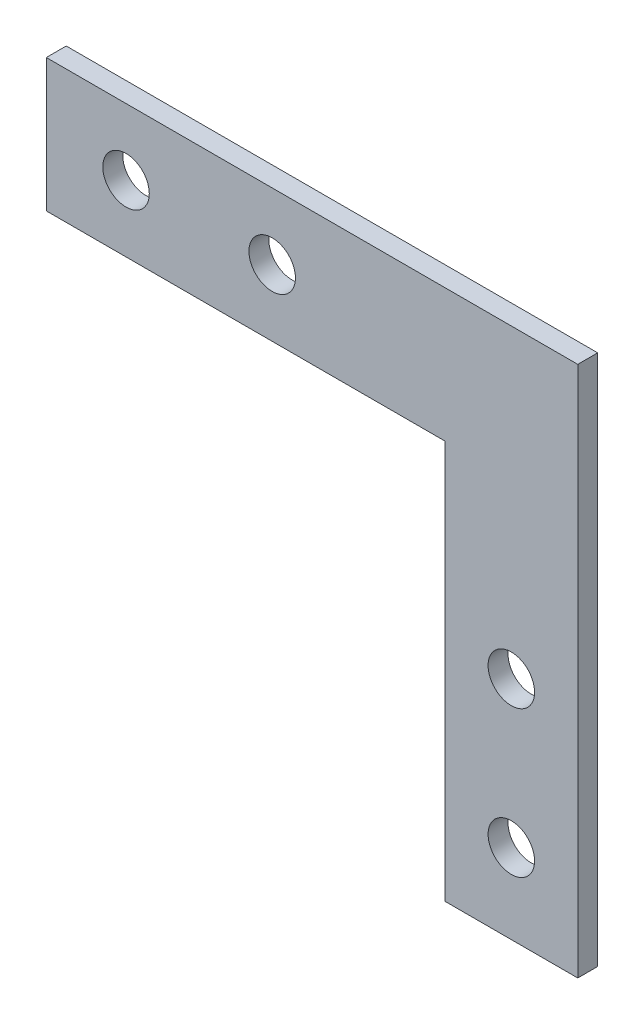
ISO-10303-21;
HEADER;
FILE_DESCRIPTION(('STEP AP214'),'2;1');
FILE_NAME('part.step','',(''),(''),'','','');
FILE_SCHEMA(('AUTOMOTIVE_DESIGN { 1 0 10303 214 1 1 1 1 }'));
ENDSEC;
DATA;
#1=APPLICATION_CONTEXT('core data for automotive mechanical design processes');
#2=APPLICATION_PROTOCOL_DEFINITION('international standard','automotive_design',2000,#1);
#3=PRODUCT_CONTEXT('',#1,'mechanical');
#4=PRODUCT('Part','Part','',(#3));
#5=PRODUCT_RELATED_PRODUCT_CATEGORY('part','',(#4));
#6=PRODUCT_DEFINITION_FORMATION('','',#4);
#7=PRODUCT_DEFINITION_CONTEXT('part definition',#1,'design');
#8=PRODUCT_DEFINITION('design','',#6,#7);
#9=PRODUCT_DEFINITION_SHAPE('','',#8);
#10=(LENGTH_UNIT() NAMED_UNIT(*) SI_UNIT(.MILLI.,.METRE.));
#11=(NAMED_UNIT(*) PLANE_ANGLE_UNIT() SI_UNIT($,.RADIAN.));
#12=(NAMED_UNIT(*) SI_UNIT($,.STERADIAN.) SOLID_ANGLE_UNIT());
#13=UNCERTAINTY_MEASURE_WITH_UNIT(LENGTH_MEASURE(1.E-05),#10,'distance_accuracy_value','');
#14=(GEOMETRIC_REPRESENTATION_CONTEXT(3) GLOBAL_UNCERTAINTY_ASSIGNED_CONTEXT((#13)) GLOBAL_UNIT_ASSIGNED_CONTEXT((#10,
#11,#12)) REPRESENTATION_CONTEXT('',''));
#15=CARTESIAN_POINT('',(0.,0.,0.));
#16=DIRECTION('',(0.,0.,1.));
#17=DIRECTION('',(1.,0.,0.));
#18=AXIS2_PLACEMENT_3D('',#15,#16,#17);
#19=CARTESIAN_POINT('',(0.,20.,3.));
#20=DIRECTION('',(0.,0.,-1.));
#21=DIRECTION('',(-1.,0.,0.));
#22=AXIS2_PLACEMENT_3D('',#19,#20,#21);
#23=PLANE('',#22);
#24=DIRECTION('',(0.,-1.,0.));
#25=VECTOR('',#24,1.);
#26=CARTESIAN_POINT('',(0.,0.,3.));
#27=LINE('',#26,#25);
#28=CARTESIAN_POINT('',(0.,20.,3.));
#29=VERTEX_POINT('',#28);
#30=CARTESIAN_POINT('',(0.,0.,3.));
#31=VERTEX_POINT('',#30);
#32=EDGE_CURVE('E130',#29,#31,#27,.T.);
#33=ORIENTED_EDGE('',*,*,#32,.T.);
#34=DIRECTION('',(1.,0.,0.));
#35=VECTOR('',#34,1.);
#36=CARTESIAN_POINT('',(0.,0.,3.));
#37=LINE('',#36,#35);
#38=CARTESIAN_POINT('',(60.,0.,3.));
#39=VERTEX_POINT('',#38);
#40=EDGE_CURVE('E87',#31,#39,#37,.T.);
#41=ORIENTED_EDGE('',*,*,#40,.T.);
#42=DIRECTION('',(0.,-1.,0.));
#43=VECTOR('',#42,1.);
#44=CARTESIAN_POINT('',(60.,0.,3.));
#45=LINE('',#44,#43);
#46=CARTESIAN_POINT('',(60.,-60.,3.));
#47=VERTEX_POINT('',#46);
#48=EDGE_CURVE('E100',#39,#47,#45,.T.);
#49=ORIENTED_EDGE('',*,*,#48,.T.);
#50=DIRECTION('',(1.,0.,0.));
#51=VECTOR('',#50,1.);
#52=CARTESIAN_POINT('',(80.,-60.,3.));
#53=LINE('',#52,#51);
#54=CARTESIAN_POINT('',(80.,-60.,3.));
#55=VERTEX_POINT('',#54);
#56=EDGE_CURVE('E94',#47,#55,#53,.T.);
#57=ORIENTED_EDGE('',*,*,#56,.T.);
#58=DIRECTION('',(0.,1.,0.));
#59=VECTOR('',#58,1.);
#60=CARTESIAN_POINT('',(80.,0.,3.));
#61=LINE('',#60,#59);
#62=CARTESIAN_POINT('',(80.,20.,3.));
#63=VERTEX_POINT('',#62);
#64=EDGE_CURVE('E98',#55,#63,#61,.T.);
#65=ORIENTED_EDGE('',*,*,#64,.T.);
#66=DIRECTION('',(-1.,0.,0.));
#67=VECTOR('',#66,1.);
#68=CARTESIAN_POINT('',(0.,20.,3.));
#69=LINE('',#68,#67);
#70=EDGE_CURVE('E51',#63,#29,#69,.T.);
#71=ORIENTED_EDGE('',*,*,#70,.T.);
#72=EDGE_LOOP('',(#33,#41,#49,#57,#65,#71));
#73=FACE_BOUND('',#72,.T.);
#74=CARTESIAN_POINT('',(12.,10.,3.));
#75=DIRECTION('',(0.,0.,1.));
#76=DIRECTION('',(1.,0.,0.));
#77=AXIS2_PLACEMENT_3D('',#74,#75,#76);
#78=CIRCLE('',#77,3.5);
#79=CARTESIAN_POINT('',(15.5,10.,3.));
#80=VERTEX_POINT('',#79);
#81=EDGE_CURVE('E123',#80,#80,#78,.T.);
#82=ORIENTED_EDGE('',*,*,#81,.F.);
#83=EDGE_LOOP('',(#82));
#84=FACE_BOUND('',#83,.T.);
#85=CARTESIAN_POINT('',(34.,10.,3.));
#86=DIRECTION('',(0.,0.,1.));
#87=DIRECTION('',(1.,0.,0.));
#88=AXIS2_PLACEMENT_3D('',#85,#86,#87);
#89=CIRCLE('',#88,3.5);
#90=CARTESIAN_POINT('',(37.5,10.,3.));
#91=VERTEX_POINT('',#90);
#92=EDGE_CURVE('E194',#91,#91,#89,.T.);
#93=ORIENTED_EDGE('',*,*,#92,.F.);
#94=EDGE_LOOP('',(#93));
#95=FACE_BOUND('',#94,.T.);
#96=CARTESIAN_POINT('',(70.,-48.,3.));
#97=DIRECTION('',(0.,0.,1.));
#98=DIRECTION('',(1.,0.,0.));
#99=AXIS2_PLACEMENT_3D('',#96,#97,#98);
#100=CIRCLE('',#99,3.50000000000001);
#101=CARTESIAN_POINT('',(73.5,-48.,3.));
#102=VERTEX_POINT('',#101);
#103=EDGE_CURVE('E188',#102,#102,#100,.T.);
#104=ORIENTED_EDGE('',*,*,#103,.F.);
#105=EDGE_LOOP('',(#104));
#106=FACE_BOUND('',#105,.T.);
#107=CARTESIAN_POINT('',(70.,-26.,3.));
#108=DIRECTION('',(0.,0.,1.));
#109=DIRECTION('',(1.,0.,0.));
#110=AXIS2_PLACEMENT_3D('',#107,#108,#109);
#111=CIRCLE('',#110,3.50000000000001);
#112=CARTESIAN_POINT('',(73.5,-26.,3.));
#113=VERTEX_POINT('',#112);
#114=EDGE_CURVE('E179',#113,#113,#111,.T.);
#115=ORIENTED_EDGE('',*,*,#114,.F.);
#116=EDGE_LOOP('',(#115));
#117=FACE_BOUND('',#116,.T.);
#118=ADVANCED_FACE('F34',(#73,#84,#95,#106,#117),#23,.F.);
#119=CARTESIAN_POINT('',(0.,20.,0.));
#120=DIRECTION('',(0.,0.,-1.));
#121=DIRECTION('',(-1.,0.,0.));
#122=AXIS2_PLACEMENT_3D('',#119,#120,#121);
#123=PLANE('',#122);
#124=CARTESIAN_POINT('',(70.,-48.,0.));
#125=DIRECTION('',(0.,0.,1.));
#126=DIRECTION('',(1.,0.,0.));
#127=AXIS2_PLACEMENT_3D('',#124,#125,#126);
#128=CIRCLE('',#127,3.50000000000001);
#129=CARTESIAN_POINT('',(73.5,-48.,0.));
#130=VERTEX_POINT('',#129);
#131=EDGE_CURVE('E185',#130,#130,#128,.T.);
#132=ORIENTED_EDGE('',*,*,#131,.T.);
#133=EDGE_LOOP('',(#132));
#134=FACE_BOUND('',#133,.T.);
#135=CARTESIAN_POINT('',(12.,10.,0.));
#136=DIRECTION('',(0.,0.,1.));
#137=DIRECTION('',(1.,0.,0.));
#138=AXIS2_PLACEMENT_3D('',#135,#136,#137);
#139=CIRCLE('',#138,3.5);
#140=CARTESIAN_POINT('',(15.5,10.,0.));
#141=VERTEX_POINT('',#140);
#142=EDGE_CURVE('E197',#141,#141,#139,.T.);
#143=ORIENTED_EDGE('',*,*,#142,.T.);
#144=EDGE_LOOP('',(#143));
#145=FACE_BOUND('',#144,.T.);
#146=DIRECTION('',(0.,-1.,0.));
#147=VECTOR('',#146,1.);
#148=CARTESIAN_POINT('',(0.,0.,0.));
#149=LINE('',#148,#147);
#150=CARTESIAN_POINT('',(0.,20.,0.));
#151=VERTEX_POINT('',#150);
#152=CARTESIAN_POINT('',(0.,0.,0.));
#153=VERTEX_POINT('',#152);
#154=EDGE_CURVE('E119',#151,#153,#149,.T.);
#155=ORIENTED_EDGE('',*,*,#154,.F.);
#156=DIRECTION('',(-1.,0.,0.));
#157=VECTOR('',#156,1.);
#158=CARTESIAN_POINT('',(0.,20.,0.));
#159=LINE('',#158,#157);
#160=CARTESIAN_POINT('',(80.,20.,0.));
#161=VERTEX_POINT('',#160);
#162=EDGE_CURVE('E79',#161,#151,#159,.T.);
#163=ORIENTED_EDGE('',*,*,#162,.F.);
#164=DIRECTION('',(0.,1.,0.));
#165=VECTOR('',#164,1.);
#166=CARTESIAN_POINT('',(80.,0.,0.));
#167=LINE('',#166,#165);
#168=CARTESIAN_POINT('',(80.,-60.,0.));
#169=VERTEX_POINT('',#168);
#170=EDGE_CURVE('E73',#169,#161,#167,.T.);
#171=ORIENTED_EDGE('',*,*,#170,.F.);
#172=DIRECTION('',(1.,0.,0.));
#173=VECTOR('',#172,1.);
#174=CARTESIAN_POINT('',(80.,-60.,0.));
#175=LINE('',#174,#173);
#176=CARTESIAN_POINT('',(60.,-60.,0.));
#177=VERTEX_POINT('',#176);
#178=EDGE_CURVE('E109',#177,#169,#175,.T.);
#179=ORIENTED_EDGE('',*,*,#178,.F.);
#180=DIRECTION('',(0.,-1.,0.));
#181=VECTOR('',#180,1.);
#182=CARTESIAN_POINT('',(60.,0.,0.));
#183=LINE('',#182,#181);
#184=CARTESIAN_POINT('',(60.,0.,0.));
#185=VERTEX_POINT('',#184);
#186=EDGE_CURVE('E125',#185,#177,#183,.T.);
#187=ORIENTED_EDGE('',*,*,#186,.F.);
#188=DIRECTION('',(1.,0.,0.));
#189=VECTOR('',#188,1.);
#190=CARTESIAN_POINT('',(0.,0.,0.));
#191=LINE('',#190,#189);
#192=EDGE_CURVE('E122',#153,#185,#191,.T.);
#193=ORIENTED_EDGE('',*,*,#192,.F.);
#194=EDGE_LOOP('',(#155,#163,#171,#179,#187,#193));
#195=FACE_BOUND('',#194,.T.);
#196=CARTESIAN_POINT('',(34.,10.,0.));
#197=DIRECTION('',(0.,0.,1.));
#198=DIRECTION('',(1.,0.,0.));
#199=AXIS2_PLACEMENT_3D('',#196,#197,#198);
#200=CIRCLE('',#199,3.5);
#201=CARTESIAN_POINT('',(37.5,10.,0.));
#202=VERTEX_POINT('',#201);
#203=EDGE_CURVE('E191',#202,#202,#200,.T.);
#204=ORIENTED_EDGE('',*,*,#203,.T.);
#205=EDGE_LOOP('',(#204));
#206=FACE_BOUND('',#205,.T.);
#207=CARTESIAN_POINT('',(70.,-26.,0.));
#208=DIRECTION('',(0.,0.,1.));
#209=DIRECTION('',(1.,0.,0.));
#210=AXIS2_PLACEMENT_3D('',#207,#208,#209);
#211=CIRCLE('',#210,3.50000000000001);
#212=CARTESIAN_POINT('',(73.5,-26.,0.));
#213=VERTEX_POINT('',#212);
#214=EDGE_CURVE('E182',#213,#213,#211,.T.);
#215=ORIENTED_EDGE('',*,*,#214,.T.);
#216=EDGE_LOOP('',(#215));
#217=FACE_BOUND('',#216,.T.);
#218=ADVANCED_FACE('F139',(#134,#145,#195,#206,#217),#123,.T.);
#219=CARTESIAN_POINT('',(0.,0.,3.));
#220=DIRECTION('',(1.,0.,0.));
#221=DIRECTION('',(0.,0.,-1.));
#222=AXIS2_PLACEMENT_3D('',#219,#220,#221);
#223=PLANE('',#222);
#224=ORIENTED_EDGE('',*,*,#154,.T.);
#225=DIRECTION('',(0.,0.,-1.));
#226=VECTOR('',#225,1.);
#227=CARTESIAN_POINT('',(0.,0.,3.));
#228=LINE('',#227,#226);
#229=EDGE_CURVE('E11',#31,#153,#228,.T.);
#230=ORIENTED_EDGE('',*,*,#229,.F.);
#231=ORIENTED_EDGE('',*,*,#32,.F.);
#232=DIRECTION('',(0.,0.,-1.));
#233=VECTOR('',#232,1.);
#234=CARTESIAN_POINT('',(0.,20.,3.));
#235=LINE('',#234,#233);
#236=EDGE_CURVE('E115',#29,#151,#235,.T.);
#237=ORIENTED_EDGE('',*,*,#236,.T.);
#238=EDGE_LOOP('',(#224,#230,#231,#237));
#239=FACE_BOUND('',#238,.T.);
#240=ADVANCED_FACE('F36',(#239),#223,.F.);
#241=CARTESIAN_POINT('',(0.,0.,3.));
#242=DIRECTION('',(0.,1.,0.));
#243=DIRECTION('',(0.,0.,1.));
#244=AXIS2_PLACEMENT_3D('',#241,#242,#243);
#245=PLANE('',#244);
#246=ORIENTED_EDGE('',*,*,#192,.T.);
#247=DIRECTION('',(0.,0.,-1.));
#248=VECTOR('',#247,1.);
#249=CARTESIAN_POINT('',(60.,0.,3.));
#250=LINE('',#249,#248);
#251=EDGE_CURVE('E43',#39,#185,#250,.T.);
#252=ORIENTED_EDGE('',*,*,#251,.F.);
#253=ORIENTED_EDGE('',*,*,#40,.F.);
#254=ORIENTED_EDGE('',*,*,#229,.T.);
#255=EDGE_LOOP('',(#246,#252,#253,#254));
#256=FACE_BOUND('',#255,.T.);
#257=ADVANCED_FACE('F258',(#256),#245,.F.);
#258=CARTESIAN_POINT('',(60.,0.,3.));
#259=DIRECTION('',(1.,0.,0.));
#260=DIRECTION('',(0.,1.,0.));
#261=AXIS2_PLACEMENT_3D('',#258,#259,#260);
#262=PLANE('',#261);
#263=ORIENTED_EDGE('',*,*,#186,.T.);
#264=DIRECTION('',(0.,0.,-1.));
#265=VECTOR('',#264,1.);
#266=CARTESIAN_POINT('',(60.,-60.,3.));
#267=LINE('',#266,#265);
#268=EDGE_CURVE('E110',#47,#177,#267,.T.);
#269=ORIENTED_EDGE('',*,*,#268,.F.);
#270=ORIENTED_EDGE('',*,*,#48,.F.);
#271=ORIENTED_EDGE('',*,*,#251,.T.);
#272=EDGE_LOOP('',(#263,#269,#270,#271));
#273=FACE_BOUND('',#272,.T.);
#274=ADVANCED_FACE('F136',(#273),#262,.F.);
#275=CARTESIAN_POINT('',(80.,-60.,3.));
#276=DIRECTION('',(0.,1.,0.));
#277=DIRECTION('',(-1.,0.,0.));
#278=AXIS2_PLACEMENT_3D('',#275,#276,#277);
#279=PLANE('',#278);
#280=ORIENTED_EDGE('',*,*,#178,.T.);
#281=DIRECTION('',(0.,0.,-1.));
#282=VECTOR('',#281,1.);
#283=CARTESIAN_POINT('',(80.,-60.,3.));
#284=LINE('',#283,#282);
#285=EDGE_CURVE('E106',#55,#169,#284,.T.);
#286=ORIENTED_EDGE('',*,*,#285,.F.);
#287=ORIENTED_EDGE('',*,*,#56,.F.);
#288=ORIENTED_EDGE('',*,*,#268,.T.);
#289=EDGE_LOOP('',(#280,#286,#287,#288));
#290=FACE_BOUND('',#289,.T.);
#291=ADVANCED_FACE('F107',(#290),#279,.F.);
#292=CARTESIAN_POINT('',(80.,0.,3.));
#293=DIRECTION('',(-1.,0.,0.));
#294=DIRECTION('',(0.,0.,1.));
#295=AXIS2_PLACEMENT_3D('',#292,#293,#294);
#296=PLANE('',#295);
#297=ORIENTED_EDGE('',*,*,#170,.T.);
#298=DIRECTION('',(0.,0.,-1.));
#299=VECTOR('',#298,1.);
#300=CARTESIAN_POINT('',(80.,20.,3.));
#301=LINE('',#300,#299);
#302=EDGE_CURVE('E111',#63,#161,#301,.T.);
#303=ORIENTED_EDGE('',*,*,#302,.F.);
#304=ORIENTED_EDGE('',*,*,#64,.F.);
#305=ORIENTED_EDGE('',*,*,#285,.T.);
#306=EDGE_LOOP('',(#297,#303,#304,#305));
#307=FACE_BOUND('',#306,.T.);
#308=ADVANCED_FACE('F113',(#307),#296,.F.);
#309=CARTESIAN_POINT('',(0.,20.,3.));
#310=DIRECTION('',(0.,-1.,0.));
#311=DIRECTION('',(0.,0.,-1.));
#312=AXIS2_PLACEMENT_3D('',#309,#310,#311);
#313=PLANE('',#312);
#314=ORIENTED_EDGE('',*,*,#162,.T.);
#315=ORIENTED_EDGE('',*,*,#236,.F.);
#316=ORIENTED_EDGE('',*,*,#70,.F.);
#317=ORIENTED_EDGE('',*,*,#302,.T.);
#318=EDGE_LOOP('',(#314,#315,#316,#317));
#319=FACE_BOUND('',#318,.T.);
#320=ADVANCED_FACE('F144',(#319),#313,.F.);
#321=CARTESIAN_POINT('',(12.,10.,3.));
#322=DIRECTION('',(0.,0.,-1.));
#323=DIRECTION('',(-1.,0.,0.));
#324=AXIS2_PLACEMENT_3D('',#321,#322,#323);
#325=CYLINDRICAL_SURFACE('',#324,3.5);
#326=ORIENTED_EDGE('',*,*,#81,.T.);
#327=EDGE_LOOP('',(#326));
#328=FACE_BOUND('',#327,.T.);
#329=ORIENTED_EDGE('',*,*,#142,.F.);
#330=EDGE_LOOP('',(#329));
#331=FACE_BOUND('',#330,.T.);
#332=ADVANCED_FACE('F146',(#328,#331),#325,.F.);
#333=CARTESIAN_POINT('',(34.,10.,3.));
#334=DIRECTION('',(0.,0.,-1.));
#335=DIRECTION('',(-1.,0.,0.));
#336=AXIS2_PLACEMENT_3D('',#333,#334,#335);
#337=CYLINDRICAL_SURFACE('',#336,3.5);
#338=ORIENTED_EDGE('',*,*,#92,.T.);
#339=EDGE_LOOP('',(#338));
#340=FACE_BOUND('',#339,.T.);
#341=ORIENTED_EDGE('',*,*,#203,.F.);
#342=EDGE_LOOP('',(#341));
#343=FACE_BOUND('',#342,.T.);
#344=ADVANCED_FACE('F152',(#340,#343),#337,.F.);
#345=CARTESIAN_POINT('',(70.,-48.,3.));
#346=DIRECTION('',(0.,0.,-1.));
#347=DIRECTION('',(-1.,0.,0.));
#348=AXIS2_PLACEMENT_3D('',#345,#346,#347);
#349=CYLINDRICAL_SURFACE('',#348,3.50000000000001);
#350=ORIENTED_EDGE('',*,*,#103,.T.);
#351=EDGE_LOOP('',(#350));
#352=FACE_BOUND('',#351,.T.);
#353=ORIENTED_EDGE('',*,*,#131,.F.);
#354=EDGE_LOOP('',(#353));
#355=FACE_BOUND('',#354,.T.);
#356=ADVANCED_FACE('F166',(#352,#355),#349,.F.);
#357=CARTESIAN_POINT('',(70.,-26.,3.));
#358=DIRECTION('',(0.,0.,-1.));
#359=DIRECTION('',(-1.,0.,0.));
#360=AXIS2_PLACEMENT_3D('',#357,#358,#359);
#361=CYLINDRICAL_SURFACE('',#360,3.50000000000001);
#362=ORIENTED_EDGE('',*,*,#114,.T.);
#363=EDGE_LOOP('',(#362));
#364=FACE_BOUND('',#363,.T.);
#365=ORIENTED_EDGE('',*,*,#214,.F.);
#366=EDGE_LOOP('',(#365));
#367=FACE_BOUND('',#366,.T.);
#368=ADVANCED_FACE('F170',(#364,#367),#361,.F.);
#369=CLOSED_SHELL('',(#118,#218,#240,#257,#274,#291,#308,#320,#332,#344,#356,#368));
#370=MANIFOLD_SOLID_BREP('B2',#369);
#371=ADVANCED_BREP_SHAPE_REPRESENTATION('',(#18,#370),#14);
#372=SHAPE_DEFINITION_REPRESENTATION(#9,#371);
ENDSEC;
END-ISO-10303-21;
